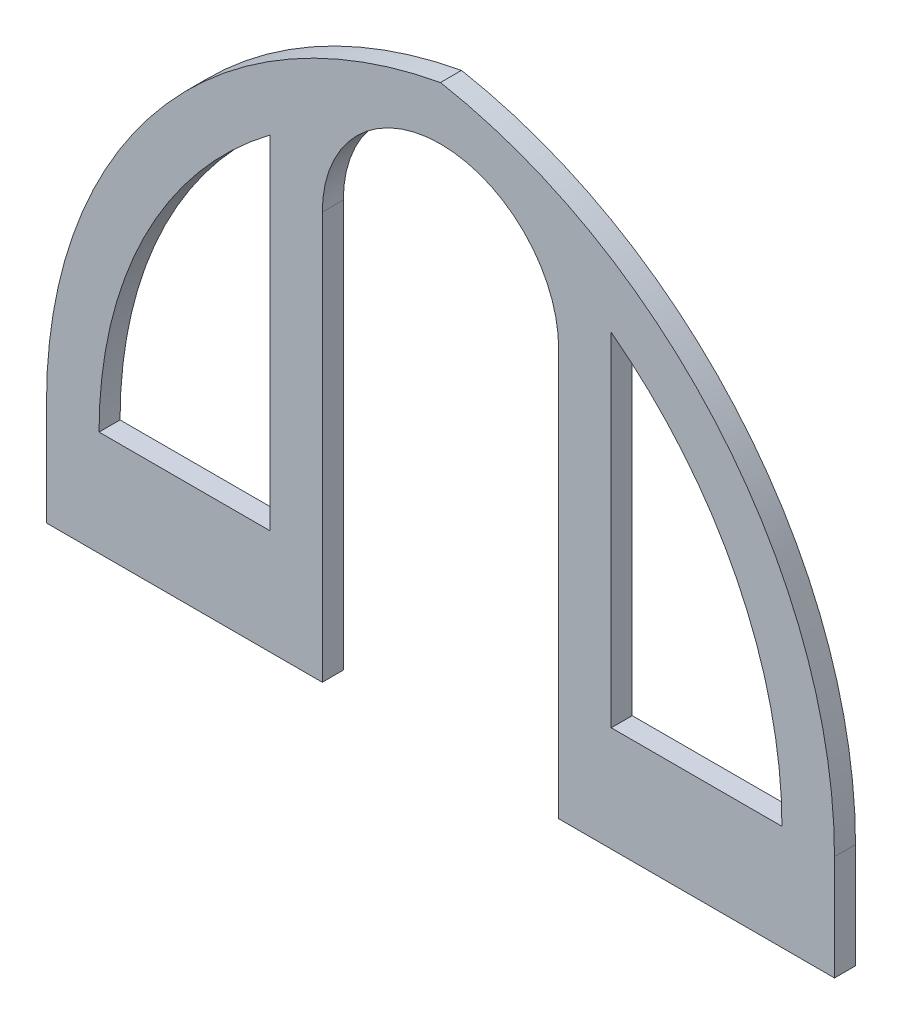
from build123d import *

# Parameters (mm, degrees)
SALIENTE_EXTRUIR1_DEPTH = 80


with BuildPart() as part:
    # Croquis1 → Saliente-Extruir1 (new body)
    with BuildSketch(Plane.XY):
        with BuildLine():
            Line((-1492.551625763, -491.370616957), (-1492.551625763, -91.370616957))
            ThreePointArc((-1492.551625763, -91.370616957), (-1068.50250592, 1081.138398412), (7.448374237, 1711.158041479))
            ThreePointArc((7.448374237, 1711.158041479), (1083.399254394, 1081.138398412), (1507.448374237, -91.370616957))
            Line((1507.448374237, -91.370616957), (1507.448374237, -491.370616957))
            Line((1507.448374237, -491.370616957), (457.448374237, -491.370616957))
            Line((457.448374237, -491.370616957), (457.448374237, 1058.629383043))
            ThreePointArc((457.448374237, 1058.629383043), (7.448374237, 1508.629383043), (-442.551625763, 1058.629383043))
            Line((-442.551625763, 1058.629383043), (-442.551625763, -491.370616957))
            Line((-442.551625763, -491.370616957), (-1492.551625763, -491.370616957))
        make_face()
        with BuildLine():
            Line((-1292.551625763, -91.370616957), (-642.551625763, -91.370616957))
            Line((-642.551625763, -91.370616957), (-642.551625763, 1212.64145275))
            ThreePointArc((-642.551625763, 1212.64145275), (-1121.045607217, 637.146280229), (-1292.551625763, -91.370616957))
        make_face(mode=Mode.SUBTRACT)
        with BuildLine():
            Line((657.448374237, 1212.64145275), (657.448374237, -91.370616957))
            Line((657.448374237, -91.370616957), (1307.448374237, -91.370616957))
            ThreePointArc((1307.448374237, -91.370616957), (1135.942355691, 637.146280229), (657.448374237, 1212.64145275))
        make_face(mode=Mode.SUBTRACT)
    extrude(amount=SALIENTE_EXTRUIR1_DEPTH)


solid = part.part
